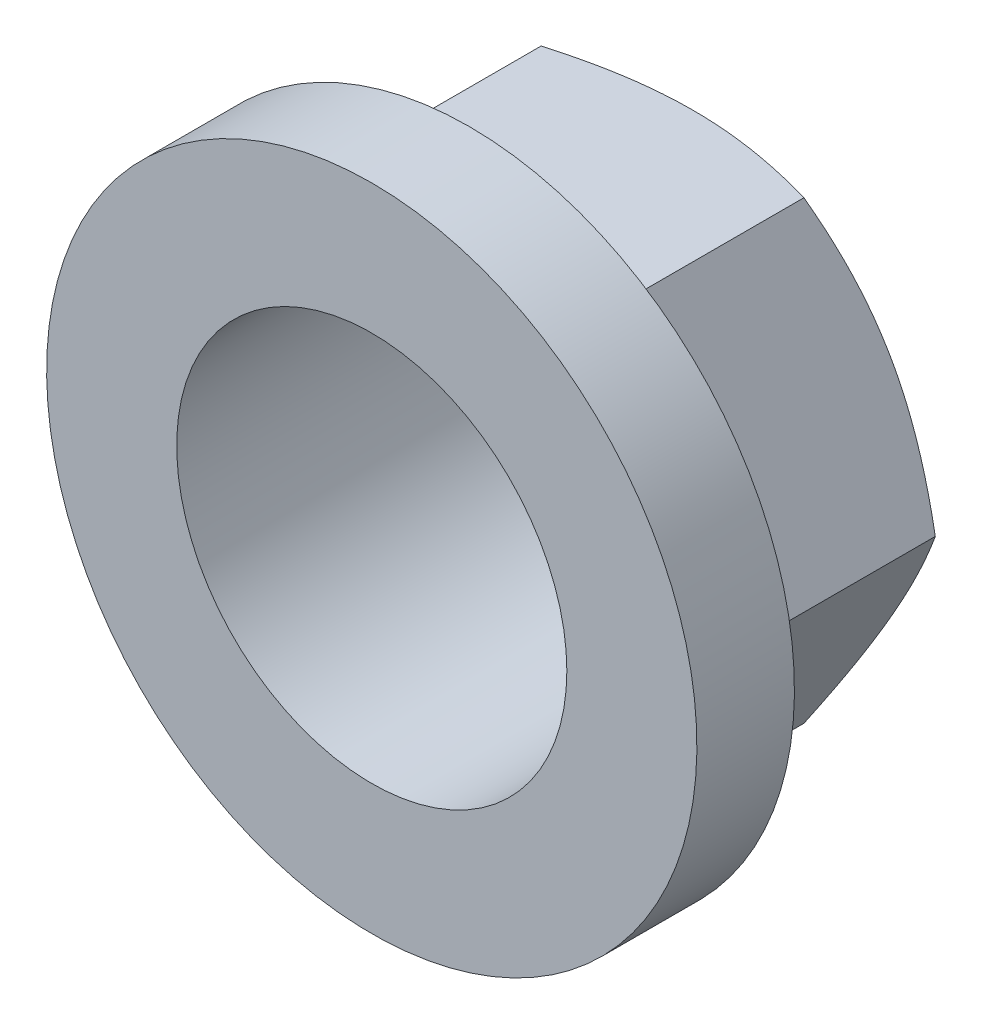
from build123d import *

# Parameters (mm, degrees)
BASE_EXTRUSION_DEPTH    = 3.75
ESQUISSE4_R             = 4.8
ENL_V_MAT_EXTRU_1_DEPTH = 14.060755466
ESQUISSE6_W             = 3
ESQUISSE6_H             = 10
ESQUISSE7_R             = 4.8
ENL_V_MAT_EXTRU_2_DEPTH = 16.724588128
ESQUISSE8_R             = 6
ENL_V_MAT_EXTRU_3_DEPTH = 18.248518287


with BuildPart() as part:
    # Esquisse1 → Base-Extrusion (new, symmetric)
    with BuildSketch(Plane.XY):
        Polygon((4.041451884, -7), (8.082903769, 0), (4.041451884, 7), (-4.041451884, 7), (-8.082903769, 0), (-4.041451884, -7), align=None)
    extrude(amount=BASE_EXTRUSION_DEPTH, both=True)

    # Esquisse4 → Enl_v. mat.-Extru.1 (cut, through all)
    with BuildSketch(Plane.XY.offset(3.75)):
        Circle(ESQUISSE4_R)
    extrude(amount=-ENL_V_MAT_EXTRU_1_DEPTH, mode=Mode.SUBTRACT)

    # Esquisse5 → Enl_vement de mati_re-R_volution1 (revolve, cut)
    with BuildSketch(Plane(origin=(0, 0, 0), x_dir=(0, 0, -1), z_dir=(1, 0, 0))):
        Polygon((3.75, -7), (-3.75, -19.990381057), (3.75, -19.990381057), align=None)
    enl_vement_de_mati_re_r_volution1 = revolve(axis=Axis((0, 0, 0), (0, 0, 1)), mode=Mode.SUBTRACT)

    # Sym_trie1: Enl_vement de mati_re-R_volution1 across plane
    add(enl_vement_de_mati_re_r_volution1.mirror(Plane.XY), mode=Mode.SUBTRACT)

    # Esquisse6 → R_volution1 (revolve)
    with BuildSketch(Plane(origin=(0, 0, 0), x_dir=(0, 0, -1), z_dir=(1, 0, 0))):
        with Locations((-4.624785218, 5)):
            Rectangle(ESQUISSE6_W, ESQUISSE6_H)
    revolve(axis=Axis((0, 0, 0), (0, 0, 1)))

    # Esquisse7 → Enl_v. mat.-Extru.2 (cut, through all)
    with BuildSketch(Plane(origin=(0, 0, 3.124785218), x_dir=(-1, 0, 0), z_dir=(0, 0, -1))):
        with Locations(Location((0, 0, 0), (0, 0, 180))):
            Circle(ESQUISSE7_R)
    extrude(amount=-ENL_V_MAT_EXTRU_2_DEPTH, mode=Mode.SUBTRACT)

    # Esquisse8 → Enl_v. mat.-Extru.3 (cut, through all)
    with BuildSketch(Plane.XY.offset(6.124785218)):
        Circle(ESQUISSE8_R)
    extrude(amount=-ENL_V_MAT_EXTRU_3_DEPTH, mode=Mode.SUBTRACT)


solid = part.part
